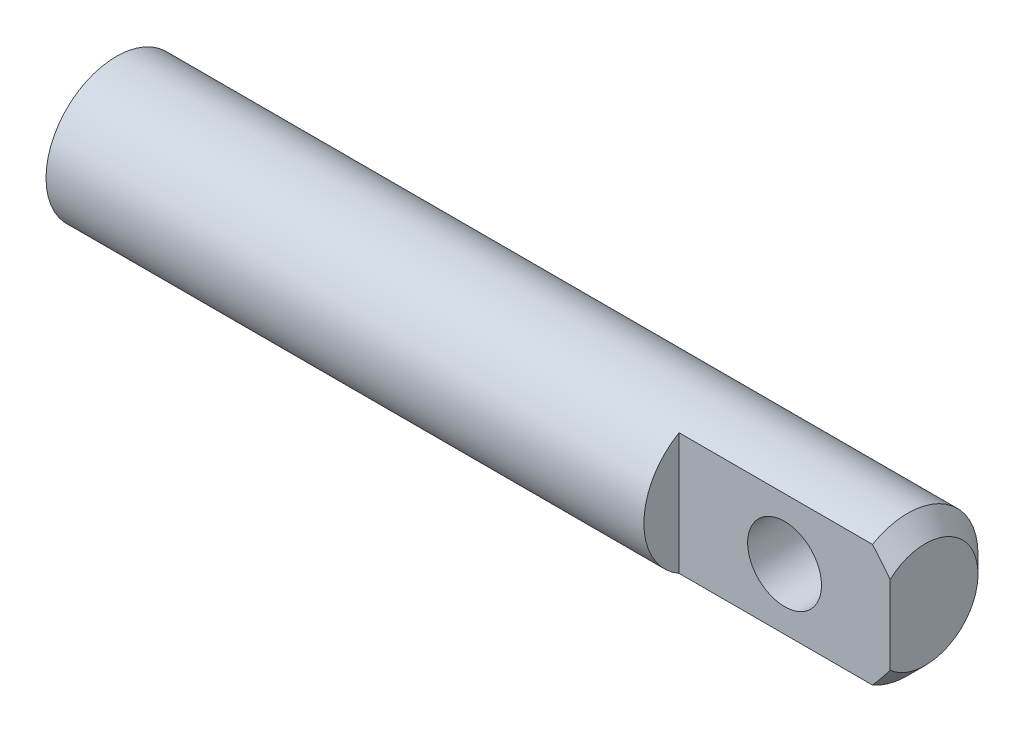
ISO-10303-21;
HEADER;
FILE_DESCRIPTION(('STEP AP214'),'2;1');
FILE_NAME('part.step','',(''),(''),'','','');
FILE_SCHEMA(('AUTOMOTIVE_DESIGN { 1 0 10303 214 1 1 1 1 }'));
ENDSEC;
DATA;
#1=APPLICATION_CONTEXT('core data for automotive mechanical design processes');
#2=APPLICATION_PROTOCOL_DEFINITION('international standard','automotive_design',2000,#1);
#3=PRODUCT_CONTEXT('',#1,'mechanical');
#4=PRODUCT('Part','Part','',(#3));
#5=PRODUCT_RELATED_PRODUCT_CATEGORY('part','',(#4));
#6=PRODUCT_DEFINITION_FORMATION('','',#4);
#7=PRODUCT_DEFINITION_CONTEXT('part definition',#1,'design');
#8=PRODUCT_DEFINITION('design','',#6,#7);
#9=PRODUCT_DEFINITION_SHAPE('','',#8);
#10=(LENGTH_UNIT() NAMED_UNIT(*) SI_UNIT(.MILLI.,.METRE.));
#11=(NAMED_UNIT(*) PLANE_ANGLE_UNIT() SI_UNIT($,.RADIAN.));
#12=(NAMED_UNIT(*) SI_UNIT($,.STERADIAN.) SOLID_ANGLE_UNIT());
#13=UNCERTAINTY_MEASURE_WITH_UNIT(LENGTH_MEASURE(1.E-05),#10,'distance_accuracy_value','');
#14=(GEOMETRIC_REPRESENTATION_CONTEXT(3) GLOBAL_UNCERTAINTY_ASSIGNED_CONTEXT((#13)) GLOBAL_UNIT_ASSIGNED_CONTEXT((#10,
#11,#12)) REPRESENTATION_CONTEXT('',''));
#15=CARTESIAN_POINT('',(0.,0.,0.));
#16=DIRECTION('',(0.,0.,1.));
#17=DIRECTION('',(1.,0.,0.));
#18=AXIS2_PLACEMENT_3D('',#15,#16,#17);
#19=CARTESIAN_POINT('',(0.,0.,0.));
#20=DIRECTION('',(1.,0.,0.));
#21=DIRECTION('',(0.,0.,-1.));
#22=AXIS2_PLACEMENT_3D('',#19,#20,#21);
#23=PLANE('',#22);
#24=CARTESIAN_POINT('',(0.,0.,0.));
#25=DIRECTION('',(-1.,0.,0.));
#26=DIRECTION('',(0.,0.,1.));
#27=AXIS2_PLACEMENT_3D('',#24,#25,#26);
#28=CIRCLE('',#27,2.);
#29=CARTESIAN_POINT('',(0.,0.,2.));
#30=VERTEX_POINT('',#29);
#31=EDGE_CURVE('E41',#30,#30,#28,.T.);
#32=ORIENTED_EDGE('',*,*,#31,.T.);
#33=EDGE_LOOP('',(#32));
#34=FACE_BOUND('',#33,.T.);
#35=ADVANCED_FACE('F34',(#34),#23,.F.);
#36=CARTESIAN_POINT('',(0.,0.,0.));
#37=DIRECTION('',(-1.,0.,0.));
#38=DIRECTION('',(0.,0.,1.));
#39=AXIS2_PLACEMENT_3D('',#36,#37,#38);
#40=CYLINDRICAL_SURFACE('',#39,2.);
#41=CARTESIAN_POINT('',(21.05,0.,-2.));
#42=CARTESIAN_POINT('',(21.0499964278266,0.0548641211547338,-1.99999683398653));
#43=CARTESIAN_POINT('',(21.0456747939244,0.109783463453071,-1.99771881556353));
#44=CARTESIAN_POINT('',(21.0285895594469,0.217977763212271,-1.98883014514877));
#45=CARTESIAN_POINT('',(21.0158121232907,0.271249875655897,-1.98221239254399));
#46=CARTESIAN_POINT('',(20.9824634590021,0.374423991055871,-1.96533181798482));
#47=CARTESIAN_POINT('',(20.9619234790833,0.424338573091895,-1.95508362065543));
#48=CARTESIAN_POINT('',(20.9138063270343,0.519927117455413,-1.93186406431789));
#49=CARTESIAN_POINT('',(20.886229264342,0.565601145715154,-1.9188927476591));
#50=CARTESIAN_POINT('',(20.8228024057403,0.65473592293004,-1.89040981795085));
#51=CARTESIAN_POINT('',(20.7865327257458,0.697862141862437,-1.87478813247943));
#52=CARTESIAN_POINT('',(20.7076628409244,0.777732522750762,-1.84309034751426));
#53=CARTESIAN_POINT('',(20.6650573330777,0.814471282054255,-1.8270138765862));
#54=CARTESIAN_POINT('',(20.5702620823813,0.883766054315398,-1.79458801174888));
#55=CARTESIAN_POINT('',(20.5175595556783,0.915672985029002,-1.77833825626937));
#56=CARTESIAN_POINT('',(20.4066105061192,0.970039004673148,-1.74927996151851));
#57=CARTESIAN_POINT('',(20.3483682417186,0.992505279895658,-1.73646880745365));
#58=CARTESIAN_POINT('',(20.2316345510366,1.02581389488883,-1.71699156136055));
#59=CARTESIAN_POINT('',(20.17338254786,1.03729066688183,-1.70999366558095));
#60=CARTESIAN_POINT('',(20.0553959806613,1.05021032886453,-1.70209360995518));
#61=CARTESIAN_POINT('',(19.9956632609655,1.05166512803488,-1.70118421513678));
#62=CARTESIAN_POINT('',(19.8851179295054,1.04496287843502,-1.70530281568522));
#63=CARTESIAN_POINT('',(19.8341911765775,1.03807876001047,-1.70954469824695));
#64=CARTESIAN_POINT('',(19.7343599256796,1.01712241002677,-1.72209458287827));
#65=CARTESIAN_POINT('',(19.6854562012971,1.00304745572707,-1.73040412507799));
#66=CARTESIAN_POINT('',(19.5896697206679,0.967881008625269,-1.75032008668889));
#67=CARTESIAN_POINT('',(19.5428584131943,0.946636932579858,-1.76199731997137));
#68=CARTESIAN_POINT('',(19.4532306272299,0.897858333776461,-1.78734588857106));
#69=CARTESIAN_POINT('',(19.4104159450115,0.870321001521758,-1.80101811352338));
#70=CARTESIAN_POINT('',(19.3236097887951,0.805196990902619,-1.8311522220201));
#71=CARTESIAN_POINT('',(19.2803113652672,0.766739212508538,-1.84773486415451));
#72=CARTESIAN_POINT('',(19.2004725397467,0.683082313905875,-1.88026963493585));
#73=CARTESIAN_POINT('',(19.1639360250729,0.637879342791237,-1.89622139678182));
#74=CARTESIAN_POINT('',(19.0967089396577,0.538834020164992,-1.9267817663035));
#75=CARTESIAN_POINT('',(19.0664607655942,0.48464945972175,-1.94126499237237));
#76=CARTESIAN_POINT('',(19.0157686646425,0.371011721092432,-1.96614386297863));
#77=CARTESIAN_POINT('',(18.9953162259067,0.311563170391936,-1.97654305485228));
#78=CARTESIAN_POINT('',(18.9666136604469,0.194698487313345,-1.9912936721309));
#79=CARTESIAN_POINT('',(18.9574465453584,0.13756541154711,-1.99609753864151));
#80=CARTESIAN_POINT('',(18.9486534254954,0.0223804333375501,-2.00070334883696));
#81=CARTESIAN_POINT('',(18.949022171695,-0.0356709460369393,-2.00050804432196));
#82=CARTESIAN_POINT('',(18.9588136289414,-0.145639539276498,-1.9953836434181));
#83=CARTESIAN_POINT('',(18.9674431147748,-0.197649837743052,-1.99086929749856));
#84=CARTESIAN_POINT('',(18.9922193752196,-0.29936409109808,-1.97813273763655));
#85=CARTESIAN_POINT('',(19.0083669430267,-0.34906780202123,-1.96991013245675));
#86=CARTESIAN_POINT('',(19.0480721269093,-0.446276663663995,-1.95022110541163));
#87=CARTESIAN_POINT('',(19.0718115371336,-0.493691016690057,-1.93867588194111));
#88=CARTESIAN_POINT('',(19.1258095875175,-0.58400578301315,-1.91341051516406));
#89=CARTESIAN_POINT('',(19.1560708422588,-0.62690437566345,-1.89968950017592));
#90=CARTESIAN_POINT('',(19.2259172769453,-0.711777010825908,-1.86965424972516));
#91=CARTESIAN_POINT('',(19.2661490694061,-0.753176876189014,-1.85321912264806));
#92=CARTESIAN_POINT('',(19.3529256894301,-0.828924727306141,-1.82060103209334));
#93=CARTESIAN_POINT('',(19.3994759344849,-0.863266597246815,-1.80441829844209));
#94=CARTESIAN_POINT('',(19.5011677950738,-0.925987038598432,-1.77309145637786));
#95=CARTESIAN_POINT('',(19.5566641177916,-0.953860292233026,-1.75807501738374));
#96=CARTESIAN_POINT('',(19.6725806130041,-0.99958188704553,-1.73249279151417));
#97=CARTESIAN_POINT('',(19.7329937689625,-1.01744423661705,-1.72192079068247));
#98=CARTESIAN_POINT('',(19.8507452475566,-1.04089614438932,-1.70783667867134));
#99=CARTESIAN_POINT('',(19.9078055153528,-1.04751606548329,-1.70373469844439));
#100=CARTESIAN_POINT('',(20.0223465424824,-1.05132201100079,-1.70139066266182));
#101=CARTESIAN_POINT('',(20.0798270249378,-1.0485137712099,-1.70314504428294));
#102=CARTESIAN_POINT('',(20.1865848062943,-1.03452866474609,-1.71166640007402));
#103=CARTESIAN_POINT('',(20.2360471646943,-1.02434795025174,-1.71783575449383));
#104=CARTESIAN_POINT('',(20.3324804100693,-0.9972297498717,-1.7337180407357));
#105=CARTESIAN_POINT('',(20.3794504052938,-0.980289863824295,-1.74343223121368));
#106=CARTESIAN_POINT('',(20.4729982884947,-0.938913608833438,-1.76607769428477));
#107=CARTESIAN_POINT('',(20.5193487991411,-0.914058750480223,-1.77917806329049));
#108=CARTESIAN_POINT('',(20.6075312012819,-0.857985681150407,-1.80688642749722));
#109=CARTESIAN_POINT('',(20.6493606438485,-0.826764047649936,-1.8214952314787));
#110=CARTESIAN_POINT('',(20.7333616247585,-0.75378362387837,-1.85299725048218));
#111=CARTESIAN_POINT('',(20.7747759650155,-0.711163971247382,-1.86992628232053));
#112=CARTESIAN_POINT('',(20.850079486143,-0.619191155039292,-1.90236151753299));
#113=CARTESIAN_POINT('',(20.8839640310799,-0.569833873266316,-1.91786684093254));
#114=CARTESIAN_POINT('',(20.9437138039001,-0.464378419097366,-1.94612151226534));
#115=CARTESIAN_POINT('',(20.969410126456,-0.408167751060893,-1.95881135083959));
#116=CARTESIAN_POINT('',(21.0106371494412,-0.291412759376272,-1.97953693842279));
#117=CARTESIAN_POINT('',(21.0261954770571,-0.230880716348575,-1.98758532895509));
#118=CARTESIAN_POINT('',(21.0408249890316,-0.141380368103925,-1.99519548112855));
#119=CARTESIAN_POINT('',(21.0442595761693,-0.113250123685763,-1.9969913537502));
#120=CARTESIAN_POINT('',(21.0488480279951,-0.0567515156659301,-1.99939444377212));
#121=CARTESIAN_POINT('',(21.0500018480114,-0.0283831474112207,-2.00000163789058));
#122=CARTESIAN_POINT('',(21.05,0.,-2.));
#123=B_SPLINE_CURVE_WITH_KNOTS('',3,(#41,#42,#43,#44,#45,#46,#47,#48,#49,#50,#51,#52,#53,#54,
#55,#56,#57,#58,#59,#60,#61,#62,#63,#64,#65,#66,#67,#68,#69,#70,#71,#72,#73,#74,#75,#76,#77,#78,
#79,#80,#81,#82,#83,#84,#85,#86,#87,#88,#89,#90,#91,#92,#93,#94,#95,#96,#97,#98,#99,#100,#101,
#102,#103,#104,#105,#106,#107,#108,#109,#110,#111,#112,#113,#114,#115,#116,#117,#118,#119,#120,
#121,#122),.UNSPECIFIED.,.T.,.F.,(4,2,2,2,2,2,2,2,2,2,2,2,2,2,2,2,2,2,2,2,2,2,2,2,2,2,2,2,2,2,2,
2,2,2,2,2,2,2,2,2,4),(0.,0.164477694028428,0.329225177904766,0.493316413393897,
0.657405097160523,0.832113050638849,1.00696806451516,1.19715271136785,1.38719232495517,
1.5654471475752,1.7434901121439,1.89746165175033,2.05149153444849,2.20903143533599,
2.36664180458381,2.54658744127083,2.72663620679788,2.91677576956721,3.10674981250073,
3.27997148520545,3.453097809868,3.61111013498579,3.76913913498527,3.93127805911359,
4.0934821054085,4.2727850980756,4.45224280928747,4.64288973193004,4.83326920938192,
5.00500930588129,5.17664494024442,5.32860681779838,5.48062270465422,5.64259984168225,
5.80466428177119,5.98920626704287,6.17386155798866,6.36211058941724,6.54984445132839,
6.63493290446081,6.72002302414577),.UNSPECIFIED.);
#124=CARTESIAN_POINT('',(21.05,0.,-2.));
#125=VERTEX_POINT('',#124);
#126=EDGE_CURVE('E72',#125,#125,#123,.T.);
#127=ORIENTED_EDGE('',*,*,#126,.T.);
#128=EDGE_LOOP('',(#127));
#129=FACE_BOUND('',#128,.T.);
#130=CARTESIAN_POINT('',(22.5,0.,0.));
#131=DIRECTION('',(-1.,0.,0.));
#132=DIRECTION('',(0.,0.,1.));
#133=AXIS2_PLACEMENT_3D('',#130,#131,#132);
#134=CIRCLE('',#133,2.);
#135=CARTESIAN_POINT('',(22.5,1.73205080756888,1.));
#136=VERTEX_POINT('',#135);
#137=CARTESIAN_POINT('',(22.5,-1.73205080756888,1.));
#138=VERTEX_POINT('',#137);
#139=EDGE_CURVE('E82',#136,#138,#134,.T.);
#140=ORIENTED_EDGE('',*,*,#139,.T.);
#141=DIRECTION('',(1.,0.,0.));
#142=VECTOR('',#141,1.);
#143=CARTESIAN_POINT('',(17.,-1.73205080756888,1.));
#144=LINE('',#143,#142);
#145=CARTESIAN_POINT('',(17.,-1.73205080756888,1.));
#146=VERTEX_POINT('',#145);
#147=EDGE_CURVE('E75',#146,#138,#144,.T.);
#148=ORIENTED_EDGE('',*,*,#147,.F.);
#149=CARTESIAN_POINT('',(17.,0.,0.));
#150=DIRECTION('',(1.,0.,0.));
#151=DIRECTION('',(0.,0.,-1.));
#152=AXIS2_PLACEMENT_3D('',#149,#150,#151);
#153=CIRCLE('',#152,2.);
#154=CARTESIAN_POINT('',(17.,1.73205080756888,1.));
#155=VERTEX_POINT('',#154);
#156=EDGE_CURVE('E66',#155,#146,#153,.T.);
#157=ORIENTED_EDGE('',*,*,#156,.F.);
#158=DIRECTION('',(1.,0.,0.));
#159=VECTOR('',#158,1.);
#160=CARTESIAN_POINT('',(17.,1.73205080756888,1.));
#161=LINE('',#160,#159);
#162=EDGE_CURVE('E76',#155,#136,#161,.T.);
#163=ORIENTED_EDGE('',*,*,#162,.T.);
#164=EDGE_LOOP('',(#140,#148,#157,#163));
#165=FACE_BOUND('',#164,.T.);
#166=ORIENTED_EDGE('',*,*,#31,.F.);
#167=EDGE_LOOP('',(#166));
#168=FACE_BOUND('',#167,.T.);
#169=ADVANCED_FACE('F79',(#129,#165,#168),#40,.T.);
#170=CARTESIAN_POINT('',(23.,0.,0.));
#171=DIRECTION('',(-1.,0.,0.));
#172=DIRECTION('',(0.,0.,1.));
#173=AXIS2_PLACEMENT_3D('',#170,#171,#172);
#174=CONICAL_SURFACE('',#173,1.5,0.785398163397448);
#175=ORIENTED_EDGE('',*,*,#139,.F.);
#176=CARTESIAN_POINT('',(20.5394260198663,3.83225080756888,1.));
#177=CARTESIAN_POINT('',(20.6241259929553,3.7447112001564,1.));
#178=CARTESIAN_POINT('',(20.7087341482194,3.65708252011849,1.));
#179=CARTESIAN_POINT('',(20.877715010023,3.4815963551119,1.));
#180=CARTESIAN_POINT('',(20.962087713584,3.39373886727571,1.));
#181=CARTESIAN_POINT('',(21.214860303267,3.12965797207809,1.));
#182=CARTESIAN_POINT('',(21.3828254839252,2.95301808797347,1.));
#183=CARTESIAN_POINT('',(21.7135109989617,2.60155131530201,1.));
#184=CARTESIAN_POINT('',(21.8762687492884,2.42675985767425,1.));
#185=CARTESIAN_POINT('',(22.1179042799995,2.16232006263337,1.));
#186=CARTESIAN_POINT('',(22.1980237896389,2.07380805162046,1.));
#187=CARTESIAN_POINT('',(22.3570727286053,1.89572176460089,1.));
#188=CARTESIAN_POINT('',(22.4360021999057,1.80614752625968,1.));
#189=CARTESIAN_POINT('',(22.5611684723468,1.66126899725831,1.));
#190=CARTESIAN_POINT('',(22.6079663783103,1.60645005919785,1.));
#191=CARTESIAN_POINT('',(22.7007217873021,1.49609455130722,1.));
#192=CARTESIAN_POINT('',(22.746679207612,1.44055791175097,1.));
#193=CARTESIAN_POINT('',(22.8379484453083,1.32797390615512,1.));
#194=CARTESIAN_POINT('',(22.8832482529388,1.27091676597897,1.));
#195=CARTESIAN_POINT('',(22.9722545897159,1.15557501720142,1.));
#196=CARTESIAN_POINT('',(23.0159612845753,1.09729053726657,1.));
#197=CARTESIAN_POINT('',(23.1017589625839,0.978170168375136,1.));
#198=CARTESIAN_POINT('',(23.1438149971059,0.917308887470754,1.));
#199=CARTESIAN_POINT('',(23.2244909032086,0.793192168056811,1.));
#200=CARTESIAN_POINT('',(23.2631060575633,0.72993360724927,1.));
#201=CARTESIAN_POINT('',(23.3344399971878,0.601150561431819,1.));
#202=CARTESIAN_POINT('',(23.3672265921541,0.535664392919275,1.));
#203=CARTESIAN_POINT('',(23.4242601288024,0.401101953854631,1.));
#204=CARTESIAN_POINT('',(23.4485358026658,0.33203868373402,1.));
#205=CARTESIAN_POINT('',(23.4747332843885,0.228445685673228,1.));
#206=CARTESIAN_POINT('',(23.4816684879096,0.195182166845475,1.));
#207=CARTESIAN_POINT('',(23.492365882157,0.128139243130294,1.));
#208=CARTESIAN_POINT('',(23.4961283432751,0.0943598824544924,1.));
#209=CARTESIAN_POINT('',(23.5002117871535,0.0266892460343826,1.));
#210=CARTESIAN_POINT('',(23.5005429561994,-0.00720139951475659,1.));
#211=CARTESIAN_POINT('',(23.4977752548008,-0.0748350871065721,1.));
#212=CARTESIAN_POINT('',(23.494676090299,-0.108578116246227,1.));
#213=CARTESIAN_POINT('',(23.4805994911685,-0.208512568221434,1.));
#214=CARTESIAN_POINT('',(23.4648761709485,-0.274066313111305,1.));
#215=CARTESIAN_POINT('',(23.4341501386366,-0.370108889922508,1.));
#216=CARTESIAN_POINT('',(23.4226684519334,-0.401841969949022,1.));
#217=CARTESIAN_POINT('',(23.3977444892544,-0.464529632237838,1.));
#218=CARTESIAN_POINT('',(23.3843026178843,-0.495484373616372,1.));
#219=CARTESIAN_POINT('',(23.3412275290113,-0.588029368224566,1.));
#220=CARTESIAN_POINT('',(23.3091323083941,-0.648465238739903,1.));
#221=CARTESIAN_POINT('',(23.2407049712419,-0.766913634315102,1.));
#222=CARTESIAN_POINT('',(23.2043676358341,-0.82492305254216,1.));
#223=CARTESIAN_POINT('',(23.1287190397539,-0.939284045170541,1.));
#224=CARTESIAN_POINT('',(23.0893965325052,-0.995628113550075,1.));
#225=CARTESIAN_POINT('',(23.0088070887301,-1.10685190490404,1.));
#226=CARTESIAN_POINT('',(22.9675411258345,-1.16173233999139,1.));
#227=CARTESIAN_POINT('',(22.8830492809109,-1.27112215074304,1.));
#228=CARTESIAN_POINT('',(22.8398046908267,-1.32561700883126,1.));
#229=CARTESIAN_POINT('',(22.7522506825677,-1.43374642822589,1.));
#230=CARTESIAN_POINT('',(22.7079411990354,-1.48738093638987,1.));
#231=CARTESIAN_POINT('',(22.5740410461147,-1.64702819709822,1.));
#232=CARTESIAN_POINT('',(22.4832698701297,-1.75204921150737,1.));
#233=CARTESIAN_POINT('',(22.3154377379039,-1.9426687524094,1.));
#234=CARTESIAN_POINT('',(22.2386729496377,-2.02853055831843,1.));
#235=CARTESIAN_POINT('',(22.0842043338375,-2.19940947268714,1.));
#236=CARTESIAN_POINT('',(22.0065004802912,-2.28442655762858,1.));
#237=CARTESIAN_POINT('',(21.7722404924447,-2.53871324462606,1.));
#238=CARTESIAN_POINT('',(21.61468051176,-2.70705628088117,1.));
#239=CARTESIAN_POINT('',(21.304543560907,-3.03540360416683,1.));
#240=CARTESIAN_POINT('',(21.1520280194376,-3.19546619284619,1.));
#241=CARTESIAN_POINT('',(20.922652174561,-3.43481167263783,1.));
#242=CARTESIAN_POINT('',(20.8461359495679,-3.51442460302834,1.));
#243=CARTESIAN_POINT('',(20.692913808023,-3.67346650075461,1.));
#244=CARTESIAN_POINT('',(20.6162078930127,-3.75289546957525,1.));
#245=CARTESIAN_POINT('',(20.5394260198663,-3.83225080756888,1.));
#246=B_SPLINE_CURVE_WITH_KNOTS('',3,(#176,#177,#178,#179,#180,#181,#182,#183,#184,#185,#186,
#187,#188,#189,#190,#191,#192,#193,#194,#195,#196,#197,#198,#199,#200,#201,#202,#203,#204,#205,
#206,#207,#208,#209,#210,#211,#212,#213,#214,#215,#216,#217,#218,#219,#220,#221,#222,#223,#224,
#225,#226,#227,#228,#229,#230,#231,#232,#233,#234,#235,#236,#237,#238,#239,#240,#241,#242,#243,
#244,#245),.UNSPECIFIED.,.F.,.F.,(4,2,2,2,2,2,2,2,2,2,2,2,2,2,2,2,2,2,2,2,2,2,2,2,2,2,2,2,2,2,2,
2,2,2,4),(0.,0.365425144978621,0.730854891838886,1.46209867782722,2.17857445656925,
2.53673226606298,2.89487741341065,3.11110360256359,3.32735095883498,3.5458908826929,
3.76440800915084,3.98626822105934,4.20842805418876,4.42780463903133,4.6464333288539,
4.7482401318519,4.8500382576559,4.95153409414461,5.053038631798,5.25410882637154,
5.35530965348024,5.45648962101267,5.66148363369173,5.86673255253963,6.07279728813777,
6.27875986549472,6.4874476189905,6.69614821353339,7.11253886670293,7.4580553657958,
7.80358145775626,8.49528494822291,9.15855260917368,9.4898173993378,9.82107950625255),.UNSPECIFIED.);
#247=CARTESIAN_POINT('',(23.,1.1180339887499,1.));
#248=VERTEX_POINT('',#247);
#249=EDGE_CURVE('E53',#136,#248,#246,.T.);
#250=ORIENTED_EDGE('',*,*,#249,.T.);
#251=CARTESIAN_POINT('',(23.,0.,0.));
#252=DIRECTION('',(-1.,0.,0.));
#253=DIRECTION('',(0.,0.,1.));
#254=AXIS2_PLACEMENT_3D('',#251,#252,#253);
#255=CIRCLE('',#254,1.5);
#256=CARTESIAN_POINT('',(23.,-1.11803398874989,1.));
#257=VERTEX_POINT('',#256);
#258=EDGE_CURVE('E92',#248,#257,#255,.T.);
#259=ORIENTED_EDGE('',*,*,#258,.T.);
#260=EDGE_CURVE('E48',#257,#138,#246,.T.);
#261=ORIENTED_EDGE('',*,*,#260,.T.);
#262=EDGE_LOOP('',(#175,#250,#259,#261));
#263=FACE_BOUND('',#262,.T.);
#264=ADVANCED_FACE('F94',(#263),#174,.T.);
#265=CARTESIAN_POINT('',(23.,1.5,0.));
#266=DIRECTION('',(-1.,0.,0.));
#267=DIRECTION('',(0.,0.,1.));
#268=AXIS2_PLACEMENT_3D('',#265,#266,#267);
#269=PLANE('',#268);
#270=ORIENTED_EDGE('',*,*,#258,.F.);
#271=DIRECTION('',(0.,-1.,0.));
#272=VECTOR('',#271,1.);
#273=CARTESIAN_POINT('',(23.,1.5,1.));
#274=LINE('',#273,#272);
#275=EDGE_CURVE('E11',#248,#257,#274,.T.);
#276=ORIENTED_EDGE('',*,*,#275,.T.);
#277=EDGE_LOOP('',(#270,#276));
#278=FACE_BOUND('',#277,.T.);
#279=ADVANCED_FACE('F100',(#278),#269,.F.);
#280=CARTESIAN_POINT('',(17.,1.73205080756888,1.));
#281=DIRECTION('',(0.,0.,-1.));
#282=DIRECTION('',(-1.,0.,0.));
#283=AXIS2_PLACEMENT_3D('',#280,#281,#282);
#284=PLANE('',#283);
#285=CARTESIAN_POINT('',(20.,0.,1.));
#286=DIRECTION('',(0.,0.,1.));
#287=DIRECTION('',(1.,0.,0.));
#288=AXIS2_PLACEMENT_3D('',#285,#286,#287);
#289=CIRCLE('',#288,1.05);
#290=CARTESIAN_POINT('',(21.05,0.,1.));
#291=VERTEX_POINT('',#290);
#292=EDGE_CURVE('E127',#291,#291,#289,.T.);
#293=ORIENTED_EDGE('',*,*,#292,.F.);
#294=EDGE_LOOP('',(#293));
#295=FACE_BOUND('',#294,.T.);
#296=ORIENTED_EDGE('',*,*,#162,.F.);
#297=DIRECTION('',(0.,1.,0.));
#298=VECTOR('',#297,1.);
#299=CARTESIAN_POINT('',(17.,1.73205080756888,1.));
#300=LINE('',#299,#298);
#301=EDGE_CURVE('E69',#146,#155,#300,.T.);
#302=ORIENTED_EDGE('',*,*,#301,.F.);
#303=ORIENTED_EDGE('',*,*,#147,.T.);
#304=ORIENTED_EDGE('',*,*,#260,.F.);
#305=ORIENTED_EDGE('',*,*,#275,.F.);
#306=ORIENTED_EDGE('',*,*,#249,.F.);
#307=EDGE_LOOP('',(#296,#302,#303,#304,#305,#306));
#308=FACE_BOUND('',#307,.T.);
#309=ADVANCED_FACE('F74',(#295,#308),#284,.F.);
#310=CARTESIAN_POINT('',(17.,0.,0.));
#311=DIRECTION('',(1.,0.,0.));
#312=DIRECTION('',(0.,0.,-1.));
#313=AXIS2_PLACEMENT_3D('',#310,#311,#312);
#314=PLANE('',#313);
#315=ORIENTED_EDGE('',*,*,#156,.T.);
#316=ORIENTED_EDGE('',*,*,#301,.T.);
#317=EDGE_LOOP('',(#315,#316));
#318=FACE_BOUND('',#317,.T.);
#319=ADVANCED_FACE('F68',(#318),#314,.T.);
#320=CARTESIAN_POINT('',(20.,0.,-2.));
#321=DIRECTION('',(0.,0.,1.));
#322=DIRECTION('',(1.,0.,0.));
#323=AXIS2_PLACEMENT_3D('',#320,#321,#322);
#324=CYLINDRICAL_SURFACE('',#323,1.05);
#325=ORIENTED_EDGE('',*,*,#292,.T.);
#326=EDGE_LOOP('',(#325));
#327=FACE_BOUND('',#326,.T.);
#328=ORIENTED_EDGE('',*,*,#126,.F.);
#329=EDGE_LOOP('',(#328));
#330=FACE_BOUND('',#329,.T.);
#331=ADVANCED_FACE('F128',(#327,#330),#324,.F.);
#332=CLOSED_SHELL('',(#35,#169,#264,#279,#309,#319,#331));
#333=MANIFOLD_SOLID_BREP('B2',#332);
#334=ADVANCED_BREP_SHAPE_REPRESENTATION('',(#18,#333),#14);
#335=SHAPE_DEFINITION_REPRESENTATION(#9,#334);
ENDSEC;
END-ISO-10303-21;
